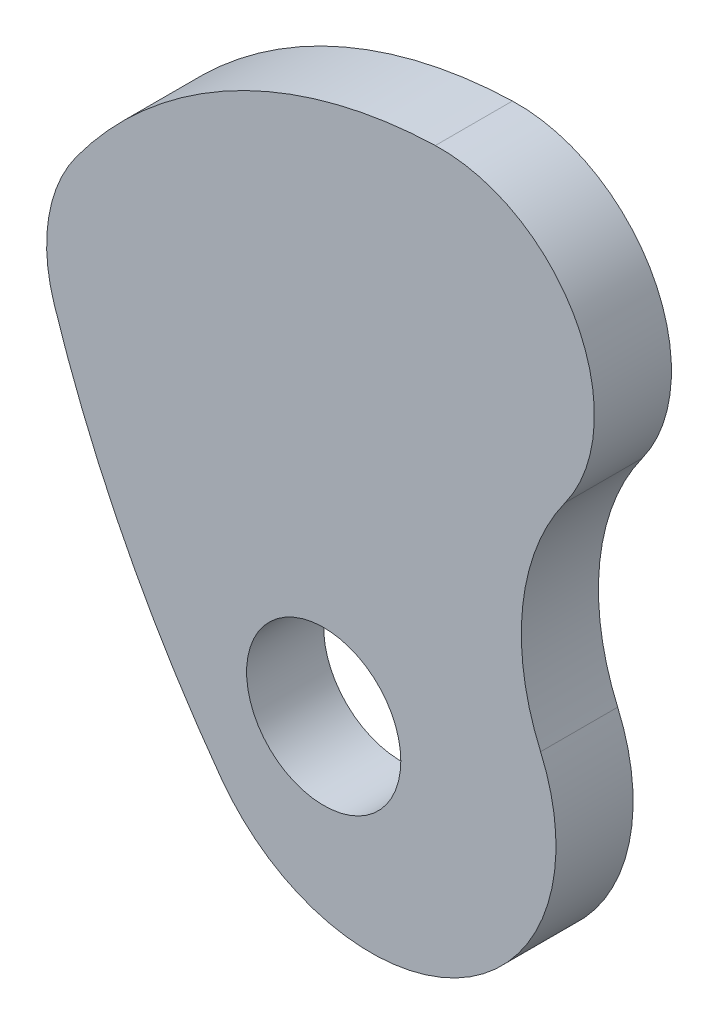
ISO-10303-21;
HEADER;
FILE_DESCRIPTION(('STEP AP214'),'2;1');
FILE_NAME('part.step','',(''),(''),'','','');
FILE_SCHEMA(('AUTOMOTIVE_DESIGN { 1 0 10303 214 1 1 1 1 }'));
ENDSEC;
DATA;
#1=APPLICATION_CONTEXT('core data for automotive mechanical design processes');
#2=APPLICATION_PROTOCOL_DEFINITION('international standard','automotive_design',2000,#1);
#3=PRODUCT_CONTEXT('',#1,'mechanical');
#4=PRODUCT('Part','Part','',(#3));
#5=PRODUCT_RELATED_PRODUCT_CATEGORY('part','',(#4));
#6=PRODUCT_DEFINITION_FORMATION('','',#4);
#7=PRODUCT_DEFINITION_CONTEXT('part definition',#1,'design');
#8=PRODUCT_DEFINITION('design','',#6,#7);
#9=PRODUCT_DEFINITION_SHAPE('','',#8);
#10=(LENGTH_UNIT() NAMED_UNIT(*) SI_UNIT(.MILLI.,.METRE.));
#11=(NAMED_UNIT(*) PLANE_ANGLE_UNIT() SI_UNIT($,.RADIAN.));
#12=(NAMED_UNIT(*) SI_UNIT($,.STERADIAN.) SOLID_ANGLE_UNIT());
#13=UNCERTAINTY_MEASURE_WITH_UNIT(LENGTH_MEASURE(1.E-05),#10,'distance_accuracy_value','');
#14=(GEOMETRIC_REPRESENTATION_CONTEXT(3) GLOBAL_UNCERTAINTY_ASSIGNED_CONTEXT((#13)) GLOBAL_UNIT_ASSIGNED_CONTEXT((#10,
#11,#12)) REPRESENTATION_CONTEXT('',''));
#15=CARTESIAN_POINT('',(0.,0.,0.));
#16=DIRECTION('',(0.,0.,1.));
#17=DIRECTION('',(1.,0.,0.));
#18=AXIS2_PLACEMENT_3D('',#15,#16,#17);
#19=CARTESIAN_POINT('',(22.9600587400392,27.5013150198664,5.));
#20=DIRECTION('',(0.,0.,1.));
#21=DIRECTION('',(1.,0.,0.));
#22=AXIS2_PLACEMENT_3D('',#19,#20,#21);
#23=PLANE('',#22);
#24=CARTESIAN_POINT('',(-7.9665546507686,17.5115910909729,5.));
#25=DIRECTION('',(0.,0.,1.));
#26=DIRECTION('',(1.,0.,0.));
#27=AXIS2_PLACEMENT_3D('',#24,#25,#26);
#28=CIRCLE('',#27,10.);
#29=CARTESIAN_POINT('',(-16.0363273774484,23.4174160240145,5.));
#30=VERTEX_POINT('',#29);
#31=CARTESIAN_POINT('',(-17.4824356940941,14.4378298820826,5.));
#32=VERTEX_POINT('',#31);
#33=EDGE_CURVE('E119',#30,#32,#28,.T.);
#34=ORIENTED_EDGE('',*,*,#33,.T.);
#35=CARTESIAN_POINT('',(53.886672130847,37.4910389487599,5.));
#36=DIRECTION('',(0.,0.,1.));
#37=DIRECTION('',(1.,0.,0.));
#38=AXIS2_PLACEMENT_3D('',#35,#36,#37);
#39=CIRCLE('',#38,75.);
#40=CARTESIAN_POINT('',(-6.61666468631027,-6.82990682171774,5.));
#41=VERTEX_POINT('',#40);
#42=EDGE_CURVE('E100',#32,#41,#39,.T.);
#43=ORIENTED_EDGE('',*,*,#42,.T.);
#44=CARTESIAN_POINT('',(3.06386920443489,0.26144450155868,5.));
#45=DIRECTION('',(0.,0.,1.));
#46=DIRECTION('',(1.,0.,0.));
#47=AXIS2_PLACEMENT_3D('',#44,#45,#46);
#48=CIRCLE('',#47,12.);
#49=CARTESIAN_POINT('',(14.0644442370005,5.05595688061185,5.));
#50=VERTEX_POINT('',#49);
#51=EDGE_CURVE('E122',#41,#50,#48,.T.);
#52=ORIENTED_EDGE('',*,*,#51,.T.);
#53=CARTESIAN_POINT('',(27.8151630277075,11.0490973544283,5.));
#54=DIRECTION('',(0.,0.,-1.));
#55=DIRECTION('',(-1.,0.,0.));
#56=AXIS2_PLACEMENT_3D('',#53,#54,#55);
#57=CIRCLE('',#56,15.);
#58=CARTESIAN_POINT('',(15.6566675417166,19.8337992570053,5.));
#59=VERTEX_POINT('',#58);
#60=EDGE_CURVE('E124',#50,#59,#57,.T.);
#61=ORIENTED_EDGE('',*,*,#60,.T.);
#62=CARTESIAN_POINT('',(7.55100388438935,25.6902671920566,5.));
#63=DIRECTION('',(0.,0.,1.));
#64=DIRECTION('',(1.,0.,0.));
#65=AXIS2_PLACEMENT_3D('',#62,#63,#64);
#66=CIRCLE('',#65,10.);
#67=CARTESIAN_POINT('',(7.24001042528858,35.68543017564,5.));
#68=VERTEX_POINT('',#67);
#69=EDGE_CURVE('E53',#59,#68,#66,.T.);
#70=ORIENTED_EDGE('',*,*,#69,.T.);
#71=CARTESIAN_POINT('',(8.17299080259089,5.69994122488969,5.));
#72=DIRECTION('',(0.,0.,1.));
#73=DIRECTION('',(-1.,0.,0.));
#74=AXIS2_PLACEMENT_3D('',#71,#72,#73);
#75=CIRCLE('',#74,30.);
#76=EDGE_CURVE('E48',#68,#30,#75,.T.);
#77=ORIENTED_EDGE('',*,*,#76,.T.);
#78=EDGE_LOOP('',(#34,#43,#52,#61,#70,#77));
#79=FACE_BOUND('',#78,.T.);
#80=CARTESIAN_POINT('',(0.,0.,5.));
#81=DIRECTION('',(0.,0.,1.));
#82=DIRECTION('',(1.,0.,0.));
#83=AXIS2_PLACEMENT_3D('',#80,#81,#82);
#84=CIRCLE('',#83,5.);
#85=CARTESIAN_POINT('',(5.,0.,5.));
#86=VERTEX_POINT('',#85);
#87=EDGE_CURVE('E105',#86,#86,#84,.T.);
#88=ORIENTED_EDGE('',*,*,#87,.F.);
#89=EDGE_LOOP('',(#88));
#90=FACE_BOUND('',#89,.T.);
#91=ADVANCED_FACE('F33',(#79,#90),#23,.T.);
#92=CARTESIAN_POINT('',(22.9600587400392,27.5013150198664,0.));
#93=DIRECTION('',(0.,0.,1.));
#94=DIRECTION('',(1.,0.,0.));
#95=AXIS2_PLACEMENT_3D('',#92,#93,#94);
#96=PLANE('',#95);
#97=CARTESIAN_POINT('',(-7.9665546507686,17.5115910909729,0.));
#98=DIRECTION('',(0.,0.,1.));
#99=DIRECTION('',(1.,0.,0.));
#100=AXIS2_PLACEMENT_3D('',#97,#98,#99);
#101=CIRCLE('',#100,10.);
#102=CARTESIAN_POINT('',(-16.0363273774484,23.4174160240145,0.));
#103=VERTEX_POINT('',#102);
#104=CARTESIAN_POINT('',(-17.4824356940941,14.4378298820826,0.));
#105=VERTEX_POINT('',#104);
#106=EDGE_CURVE('E91',#103,#105,#101,.T.);
#107=ORIENTED_EDGE('',*,*,#106,.F.);
#108=CARTESIAN_POINT('',(8.17299080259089,5.69994122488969,0.));
#109=DIRECTION('',(0.,0.,1.));
#110=DIRECTION('',(-1.,0.,0.));
#111=AXIS2_PLACEMENT_3D('',#108,#109,#110);
#112=CIRCLE('',#111,30.);
#113=CARTESIAN_POINT('',(7.24001042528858,35.68543017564,0.));
#114=VERTEX_POINT('',#113);
#115=EDGE_CURVE('E117',#114,#103,#112,.T.);
#116=ORIENTED_EDGE('',*,*,#115,.F.);
#117=CARTESIAN_POINT('',(7.55100388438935,25.6902671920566,0.));
#118=DIRECTION('',(0.,0.,1.));
#119=DIRECTION('',(1.,0.,0.));
#120=AXIS2_PLACEMENT_3D('',#117,#118,#119);
#121=CIRCLE('',#120,10.);
#122=CARTESIAN_POINT('',(15.6566675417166,19.8337992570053,0.));
#123=VERTEX_POINT('',#122);
#124=EDGE_CURVE('E115',#123,#114,#121,.T.);
#125=ORIENTED_EDGE('',*,*,#124,.F.);
#126=CARTESIAN_POINT('',(27.8151630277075,11.0490973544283,0.));
#127=DIRECTION('',(0.,0.,-1.));
#128=DIRECTION('',(-1.,0.,0.));
#129=AXIS2_PLACEMENT_3D('',#126,#127,#128);
#130=CIRCLE('',#129,15.);
#131=CARTESIAN_POINT('',(14.0644442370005,5.05595688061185,0.));
#132=VERTEX_POINT('',#131);
#133=EDGE_CURVE('E113',#132,#123,#130,.T.);
#134=ORIENTED_EDGE('',*,*,#133,.F.);
#135=CARTESIAN_POINT('',(3.06386920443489,0.26144450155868,0.));
#136=DIRECTION('',(0.,0.,1.));
#137=DIRECTION('',(1.,0.,0.));
#138=AXIS2_PLACEMENT_3D('',#135,#136,#137);
#139=CIRCLE('',#138,12.);
#140=CARTESIAN_POINT('',(-6.61666468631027,-6.82990682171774,0.));
#141=VERTEX_POINT('',#140);
#142=EDGE_CURVE('E93',#141,#132,#139,.T.);
#143=ORIENTED_EDGE('',*,*,#142,.F.);
#144=CARTESIAN_POINT('',(53.886672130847,37.4910389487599,0.));
#145=DIRECTION('',(0.,0.,1.));
#146=DIRECTION('',(1.,0.,0.));
#147=AXIS2_PLACEMENT_3D('',#144,#145,#146);
#148=CIRCLE('',#147,75.);
#149=EDGE_CURVE('E86',#105,#141,#148,.T.);
#150=ORIENTED_EDGE('',*,*,#149,.F.);
#151=EDGE_LOOP('',(#107,#116,#125,#134,#143,#150));
#152=FACE_BOUND('',#151,.T.);
#153=CARTESIAN_POINT('',(0.,0.,0.));
#154=DIRECTION('',(0.,0.,1.));
#155=DIRECTION('',(1.,0.,0.));
#156=AXIS2_PLACEMENT_3D('',#153,#154,#155);
#157=CIRCLE('',#156,5.);
#158=CARTESIAN_POINT('',(5.,0.,0.));
#159=VERTEX_POINT('',#158);
#160=EDGE_CURVE('E108',#159,#159,#157,.T.);
#161=ORIENTED_EDGE('',*,*,#160,.T.);
#162=EDGE_LOOP('',(#161));
#163=FACE_BOUND('',#162,.T.);
#164=ADVANCED_FACE('F87',(#152,#163),#96,.F.);
#165=CARTESIAN_POINT('',(-7.9665546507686,17.5115910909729,5.));
#166=DIRECTION('',(0.,0.,-1.));
#167=DIRECTION('',(-1.,0.,0.));
#168=AXIS2_PLACEMENT_3D('',#165,#166,#167);
#169=CYLINDRICAL_SURFACE('',#168,10.);
#170=ORIENTED_EDGE('',*,*,#106,.T.);
#171=DIRECTION('',(0.,0.,-1.));
#172=VECTOR('',#171,1.);
#173=CARTESIAN_POINT('',(-17.4824356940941,14.4378298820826,5.));
#174=LINE('',#173,#172);
#175=EDGE_CURVE('E11',#32,#105,#174,.T.);
#176=ORIENTED_EDGE('',*,*,#175,.F.);
#177=ORIENTED_EDGE('',*,*,#33,.F.);
#178=DIRECTION('',(0.,0.,-1.));
#179=VECTOR('',#178,1.);
#180=CARTESIAN_POINT('',(-16.0363273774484,23.4174160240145,5.));
#181=LINE('',#180,#179);
#182=EDGE_CURVE('E104',#30,#103,#181,.T.);
#183=ORIENTED_EDGE('',*,*,#182,.T.);
#184=EDGE_LOOP('',(#170,#176,#177,#183));
#185=FACE_BOUND('',#184,.T.);
#186=ADVANCED_FACE('F35',(#185),#169,.T.);
#187=CARTESIAN_POINT('',(53.886672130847,37.4910389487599,5.));
#188=DIRECTION('',(0.,0.,-1.));
#189=DIRECTION('',(-1.,0.,0.));
#190=AXIS2_PLACEMENT_3D('',#187,#188,#189);
#191=CYLINDRICAL_SURFACE('',#190,75.);
#192=ORIENTED_EDGE('',*,*,#149,.T.);
#193=DIRECTION('',(0.,0.,-1.));
#194=VECTOR('',#193,1.);
#195=CARTESIAN_POINT('',(-6.61666468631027,-6.82990682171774,5.));
#196=LINE('',#195,#194);
#197=EDGE_CURVE('E41',#41,#141,#196,.T.);
#198=ORIENTED_EDGE('',*,*,#197,.F.);
#199=ORIENTED_EDGE('',*,*,#42,.F.);
#200=ORIENTED_EDGE('',*,*,#175,.T.);
#201=EDGE_LOOP('',(#192,#198,#199,#200));
#202=FACE_BOUND('',#201,.T.);
#203=ADVANCED_FACE('F99',(#202),#191,.T.);
#204=CARTESIAN_POINT('',(3.06386920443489,0.26144450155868,5.));
#205=DIRECTION('',(0.,0.,-1.));
#206=DIRECTION('',(-1.,0.,0.));
#207=AXIS2_PLACEMENT_3D('',#204,#205,#206);
#208=CYLINDRICAL_SURFACE('',#207,12.);
#209=ORIENTED_EDGE('',*,*,#142,.T.);
#210=DIRECTION('',(0.,0.,-1.));
#211=VECTOR('',#210,1.);
#212=CARTESIAN_POINT('',(14.0644442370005,5.05595688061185,5.));
#213=LINE('',#212,#211);
#214=EDGE_CURVE('E135',#50,#132,#213,.T.);
#215=ORIENTED_EDGE('',*,*,#214,.F.);
#216=ORIENTED_EDGE('',*,*,#51,.F.);
#217=ORIENTED_EDGE('',*,*,#197,.T.);
#218=EDGE_LOOP('',(#209,#215,#216,#217));
#219=FACE_BOUND('',#218,.T.);
#220=ADVANCED_FACE('F139',(#219),#208,.T.);
#221=CARTESIAN_POINT('',(27.8151630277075,11.0490973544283,5.));
#222=DIRECTION('',(0.,0.,-1.));
#223=DIRECTION('',(-1.,0.,0.));
#224=AXIS2_PLACEMENT_3D('',#221,#222,#223);
#225=CYLINDRICAL_SURFACE('',#224,15.);
#226=ORIENTED_EDGE('',*,*,#133,.T.);
#227=DIRECTION('',(0.,0.,-1.));
#228=VECTOR('',#227,1.);
#229=CARTESIAN_POINT('',(15.6566675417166,19.8337992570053,5.));
#230=LINE('',#229,#228);
#231=EDGE_CURVE('E132',#59,#123,#230,.T.);
#232=ORIENTED_EDGE('',*,*,#231,.F.);
#233=ORIENTED_EDGE('',*,*,#60,.F.);
#234=ORIENTED_EDGE('',*,*,#214,.T.);
#235=EDGE_LOOP('',(#226,#232,#233,#234));
#236=FACE_BOUND('',#235,.T.);
#237=ADVANCED_FACE('F145',(#236),#225,.F.);
#238=CARTESIAN_POINT('',(7.55100388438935,25.6902671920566,5.));
#239=DIRECTION('',(0.,0.,-1.));
#240=DIRECTION('',(-1.,0.,0.));
#241=AXIS2_PLACEMENT_3D('',#238,#239,#240);
#242=CYLINDRICAL_SURFACE('',#241,10.);
#243=ORIENTED_EDGE('',*,*,#124,.T.);
#244=DIRECTION('',(0.,0.,-1.));
#245=VECTOR('',#244,1.);
#246=CARTESIAN_POINT('',(7.24001042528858,35.68543017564,5.));
#247=LINE('',#246,#245);
#248=EDGE_CURVE('E129',#68,#114,#247,.T.);
#249=ORIENTED_EDGE('',*,*,#248,.F.);
#250=ORIENTED_EDGE('',*,*,#69,.F.);
#251=ORIENTED_EDGE('',*,*,#231,.T.);
#252=EDGE_LOOP('',(#243,#249,#250,#251));
#253=FACE_BOUND('',#252,.T.);
#254=ADVANCED_FACE('F148',(#253),#242,.T.);
#255=CARTESIAN_POINT('',(8.17299080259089,5.69994122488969,5.));
#256=DIRECTION('',(0.,0.,-1.));
#257=DIRECTION('',(-1.,0.,0.));
#258=AXIS2_PLACEMENT_3D('',#255,#256,#257);
#259=CYLINDRICAL_SURFACE('',#258,30.);
#260=ORIENTED_EDGE('',*,*,#115,.T.);
#261=ORIENTED_EDGE('',*,*,#182,.F.);
#262=ORIENTED_EDGE('',*,*,#76,.F.);
#263=ORIENTED_EDGE('',*,*,#248,.T.);
#264=EDGE_LOOP('',(#260,#261,#262,#263));
#265=FACE_BOUND('',#264,.T.);
#266=ADVANCED_FACE('F150',(#265),#259,.T.);
#267=CARTESIAN_POINT('',(0.,0.,5.));
#268=DIRECTION('',(0.,0.,-1.));
#269=DIRECTION('',(-1.,0.,0.));
#270=AXIS2_PLACEMENT_3D('',#267,#268,#269);
#271=CYLINDRICAL_SURFACE('',#270,5.);
#272=ORIENTED_EDGE('',*,*,#87,.T.);
#273=EDGE_LOOP('',(#272));
#274=FACE_BOUND('',#273,.T.);
#275=ORIENTED_EDGE('',*,*,#160,.F.);
#276=EDGE_LOOP('',(#275));
#277=FACE_BOUND('',#276,.T.);
#278=ADVANCED_FACE('F152',(#274,#277),#271,.F.);
#279=CLOSED_SHELL('',(#91,#164,#186,#203,#220,#237,#254,#266,#278));
#280=MANIFOLD_SOLID_BREP('B2',#279);
#281=ADVANCED_BREP_SHAPE_REPRESENTATION('',(#18,#280),#14);
#282=SHAPE_DEFINITION_REPRESENTATION(#9,#281);
ENDSEC;
END-ISO-10303-21;
